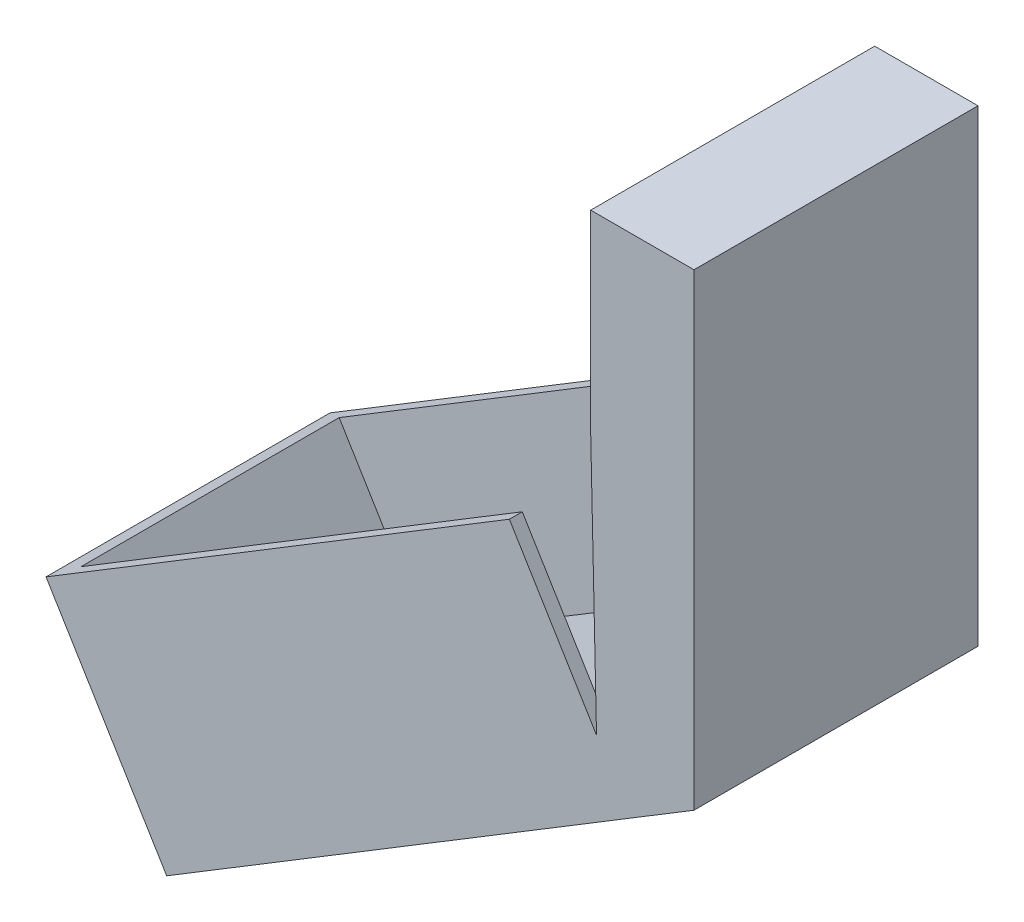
from build123d import *

# Parameters (mm, degrees)
BOSS_EXTRUDE1_DEPTH = 22
SKETCH2_W           = 8
SKETCH2_H           = 22
BOSS_EXTRUDE2_DEPTH = 15
SKETCH3_W           = 2
SKETCH3_H           = 22
BOSS_EXTRUDE3_DEPTH = 10
SKETCH4_W           = 40
SKETCH4_H           = 1
BOSS_EXTRUDE4_DEPTH = 13


with BuildPart() as part:
    # Sketch1 → Boss-Extrude1 (new body)
    with BuildSketch(Plane.XY):
        Polygon((0, 0), (0.449712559, -19.994943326), (-33.732832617, -40.768811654), (-35.290872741, -38.205120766), (-37, -39.243814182), (-32.845226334, -46.080323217), (8, -21.2573222), (8, 0), align=None)
    extrude(amount=BOSS_EXTRUDE1_DEPTH)

    # Sketch2 → Boss-Extrude2 (add)
    with BuildSketch(Plane(origin=(0, 0, 0), x_dir=(1, 0, 0), z_dir=(0, 1, 0))):
        with Locations((4, -11)):
            Rectangle(SKETCH2_W, SKETCH2_H)
    extrude(amount=BOSS_EXTRUDE2_DEPTH)

    # Sketch3 → Boss-Extrude3 (add)
    with BuildSketch(Plane(origin=(7.437308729, -12.237785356, 0), x_dir=(0.8545636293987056, 0.5193467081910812, 0), z_dir=(-0.5193467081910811, 0.8545636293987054, 0))):
        with Locations((-51, -11)):
            Rectangle(SKETCH3_W, SKETCH3_H)
    extrude(amount=BOSS_EXTRUDE3_DEPTH)

    # Sketch4 → Boss-Extrude4 (add)
    with BuildSketch(Plane(origin=(8.995348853, -14.801476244, 0), x_dir=(0.854563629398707, 0.5193467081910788, 0), z_dir=(-0.5193467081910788, 0.854563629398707, 0))):
        with Locations((-30, -0.5)):
            Rectangle(SKETCH4_W, SKETCH4_H)
        with Locations((-30, -21.5)):
            Rectangle(SKETCH4_W, SKETCH4_H)
    extrude(amount=BOSS_EXTRUDE4_DEPTH)


solid = part.part
